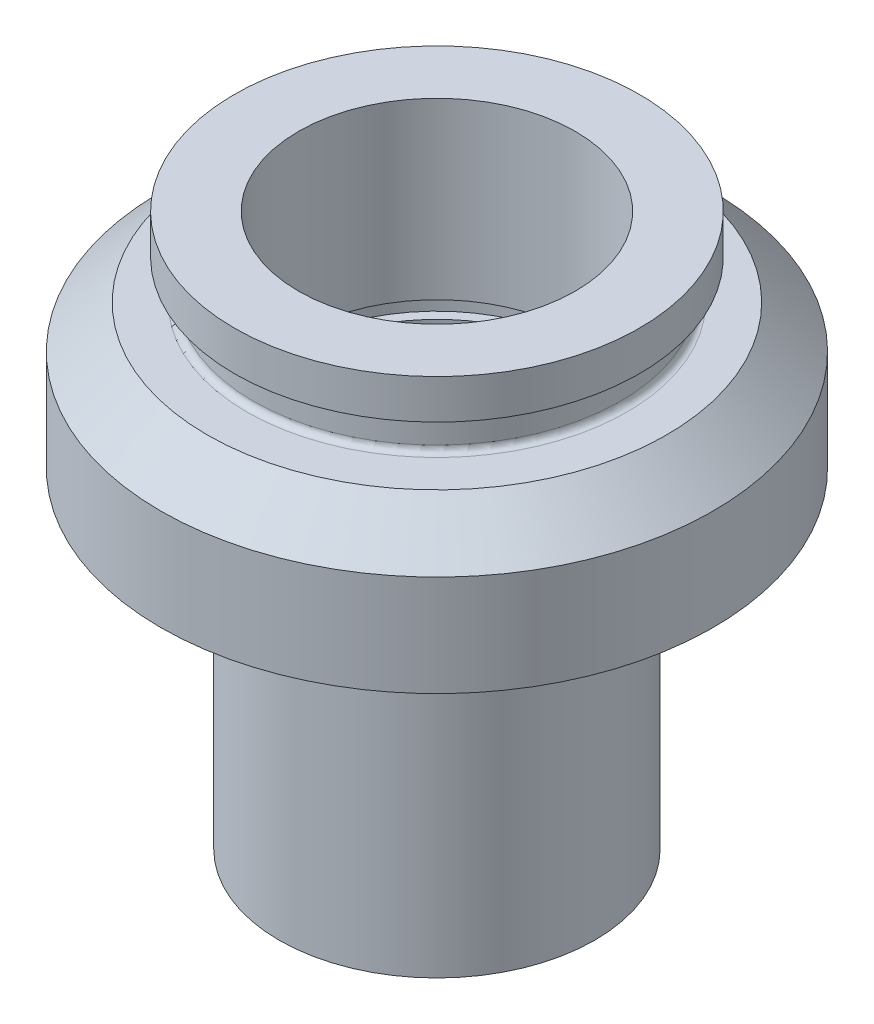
from build123d import *


with BuildPart() as part:
    # Sketch2 → Revolve1 (revolve)
    with BuildSketch(Plane(origin=(0, 0, 0), x_dir=(0, 0, -1), z_dir=(1, 0, 0))):
        with BuildLine():
            Line((-8.75665, 0), (-8.75665, -25.4))
            Line((-8.75665, -25.4), (-12.7, -25.4))
            Line((-12.7, -25.4), (-12.7, -3.5179))
            Line((-12.7, -3.5179), (-11.41095, -3.5179))
            Line((-11.41095, -3.5179), (-11.41095, -0.254))
            ThreePointArc((-11.41095, -0.254), (-11.485344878, -0.074394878), (-11.66495, 0))
            Line((-11.66495, 0), (-14.99235, 0))
            Line((-14.99235, 0), (-14.99235, 2.29933049))
            Line((-14.99235, 2.29933049), (-18.82775, 2.29933049))
            Line((-18.82775, 2.29933049), (-18.82775, 0))
            Line((-18.82775, 0), (-20.21205, 0))
            Line((-20.21205, 0), (-20.21205, 1.149665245))
            Line((-20.21205, 1.149665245), (-22.225, 1.149665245))
            Line((-22.225, 1.149665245), (-22.225, 9.271))
            Line((-22.225, 9.271), (-18.4785, 12.7))
            Line((-18.4785, 12.7), (-15.289162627, 12.7))
            ThreePointArc((-15.289162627, 12.7), (-14.929952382, 12.848789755), (-14.781162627, 13.208))
            Line((-14.781162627, 13.208), (-14.781162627, 15.367))
            ThreePointArc((-14.781162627, 15.367), (-14.929952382, 15.726210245), (-15.289162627, 15.875))
            Line((-15.289162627, 15.875), (-16.294627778, 15.875))
            Line((-16.294627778, 15.875), (-16.294627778, 19.05))
            Line((-16.294627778, 19.05), (-11.1379, 19.05))
            Line((-11.1379, 19.05), (-11.1379, 5.010955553))
            Line((-11.1379, 5.010955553), (-11.938, 5.010955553))
            Line((-11.938, 5.010955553), (-11.938, 3.647859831))
            Line((-11.938, 3.647859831), (-11.1379, 3.647859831))
            Line((-11.1379, 3.647859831), (-11.1379, 2.29933049))
            Line((-11.1379, 2.29933049), (-8.75665, 2.29933049))
            Line((-8.75665, 2.29933049), (-8.75665, 0))
        make_face()
    revolve(axis=Axis((0, 21.799368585, 0), (0, -1, 0)))


solid = part.part
